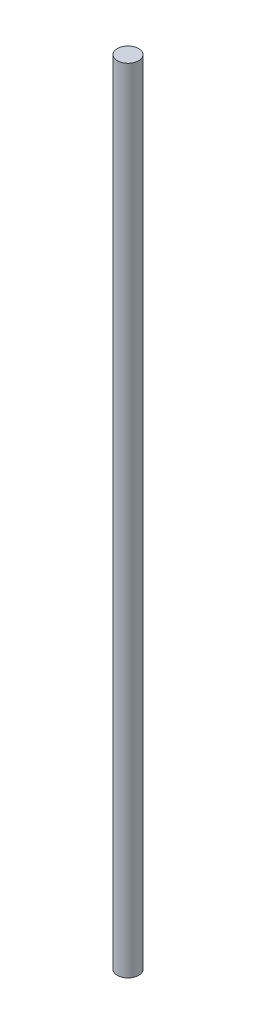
from build123d import *

# Parameters (mm, degrees)
SKETCH1_R           = 4
BOSS_EXTRUDE1_DEPTH = 305
SKETCH2_R           = 4
CUT_EXTRUDE1_DEPTH  = 6


with BuildPart() as part:
    # Sketch1 → Boss-Extrude1 (new body)
    with BuildSketch(Plane(origin=(0, 0, 0), x_dir=(1, 0, 0), z_dir=(0, 1, 0))):
        with Locations(Location((0, 0, 0), (0, 0, 270))):
            Circle(SKETCH1_R)
    extrude(amount=BOSS_EXTRUDE1_DEPTH)

    # Sketch2 → Cut-Extrude1 (cut)
    with BuildSketch(Plane(origin=(-24.010459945, 0, 31.773390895), x_dir=(0.9917716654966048, 0, 0.12801938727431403), z_dir=(0, -1, 0))):
        with Locations(Location((19.745283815, -34.585753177, 0), (0, 0, 262.644844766))):
            Circle(SKETCH2_R)
    extrude(amount=-CUT_EXTRUDE1_DEPTH, mode=Mode.SUBTRACT)


solid = part.part
